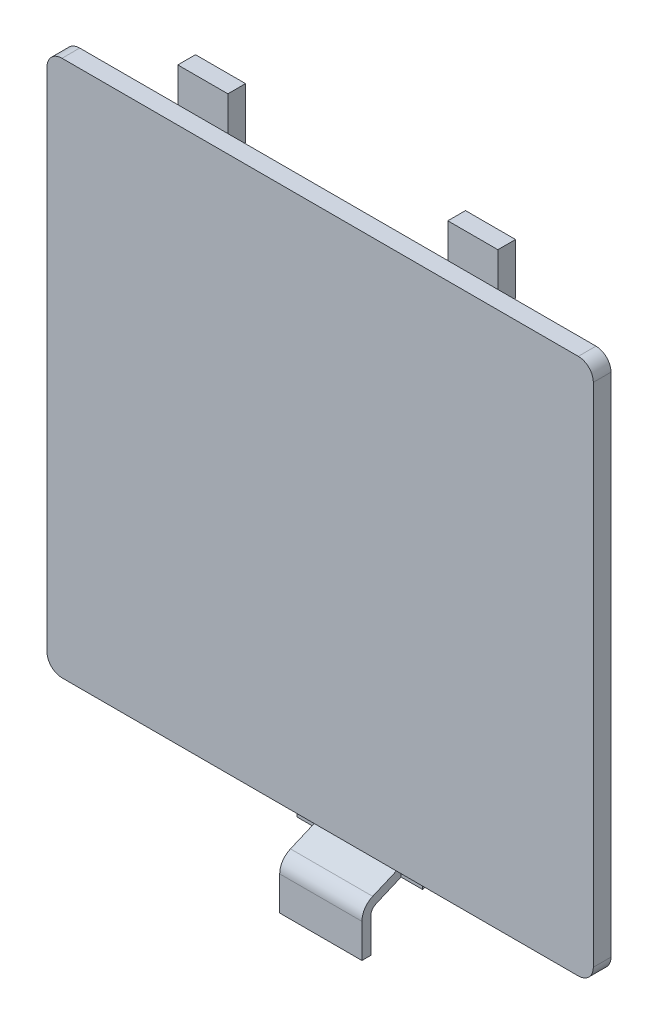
ISO-10303-21;
HEADER;
FILE_DESCRIPTION(('STEP AP214'),'2;1');
FILE_NAME('part.step','',(''),(''),'','','');
FILE_SCHEMA(('AUTOMOTIVE_DESIGN { 1 0 10303 214 1 1 1 1 }'));
ENDSEC;
DATA;
#1=APPLICATION_CONTEXT('core data for automotive mechanical design processes');
#2=APPLICATION_PROTOCOL_DEFINITION('international standard','automotive_design',2000,#1);
#3=PRODUCT_CONTEXT('',#1,'mechanical');
#4=PRODUCT('Part','Part','',(#3));
#5=PRODUCT_RELATED_PRODUCT_CATEGORY('part','',(#4));
#6=PRODUCT_DEFINITION_FORMATION('','',#4);
#7=PRODUCT_DEFINITION_CONTEXT('part definition',#1,'design');
#8=PRODUCT_DEFINITION('design','',#6,#7);
#9=PRODUCT_DEFINITION_SHAPE('','',#8);
#10=(LENGTH_UNIT() NAMED_UNIT(*) SI_UNIT(.MILLI.,.METRE.));
#11=(NAMED_UNIT(*) PLANE_ANGLE_UNIT() SI_UNIT($,.RADIAN.));
#12=(NAMED_UNIT(*) SI_UNIT($,.STERADIAN.) SOLID_ANGLE_UNIT());
#13=UNCERTAINTY_MEASURE_WITH_UNIT(LENGTH_MEASURE(1.E-05),#10,'distance_accuracy_value','');
#14=(GEOMETRIC_REPRESENTATION_CONTEXT(3) GLOBAL_UNCERTAINTY_ASSIGNED_CONTEXT((#13)) GLOBAL_UNIT_ASSIGNED_CONTEXT((#10,
#11,#12)) REPRESENTATION_CONTEXT('',''));
#15=CARTESIAN_POINT('',(0.,0.,0.));
#16=DIRECTION('',(0.,0.,1.));
#17=DIRECTION('',(1.,0.,0.));
#18=AXIS2_PLACEMENT_3D('',#15,#16,#17);
#19=CARTESIAN_POINT('',(29.2,20.6517184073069,-2.));
#20=DIRECTION('',(0.,0.,-1.));
#21=DIRECTION('',(0.,1.,0.));
#22=AXIS2_PLACEMENT_3D('',#19,#20,#21);
#23=PLANE('',#22);
#24=DIRECTION('',(0.,1.,0.));
#25=VECTOR('',#24,1.);
#26=CARTESIAN_POINT('',(7.1,-38.4982815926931,-2.));
#27=LINE('',#26,#25);
#28=CARTESIAN_POINT('',(7.1,-38.3482815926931,-2.));
#29=VERTEX_POINT('',#28);
#30=CARTESIAN_POINT('',(7.1,-37.4982815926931,-2.));
#31=VERTEX_POINT('',#30);
#32=EDGE_CURVE('E487',#29,#31,#27,.T.);
#33=ORIENTED_EDGE('',*,*,#32,.T.);
#34=DIRECTION('',(-1.,0.,0.));
#35=VECTOR('',#34,1.);
#36=CARTESIAN_POINT('',(7.1,-37.4982815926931,-2.));
#37=LINE('',#36,#35);
#38=CARTESIAN_POINT('',(-7.1,-37.4982815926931,-2.));
#39=VERTEX_POINT('',#38);
#40=EDGE_CURVE('E289',#31,#39,#37,.T.);
#41=ORIENTED_EDGE('',*,*,#40,.T.);
#42=DIRECTION('',(0.,1.,0.));
#43=VECTOR('',#42,1.);
#44=CARTESIAN_POINT('',(-7.1,-38.4982815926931,-2.));
#45=LINE('',#44,#43);
#46=CARTESIAN_POINT('',(-7.1,-38.3482815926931,-2.));
#47=VERTEX_POINT('',#46);
#48=EDGE_CURVE('E458',#47,#39,#45,.T.);
#49=ORIENTED_EDGE('',*,*,#48,.F.);
#50=DIRECTION('',(1.,0.,0.));
#51=VECTOR('',#50,1.);
#52=CARTESIAN_POINT('',(7.85,-38.3482815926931,-2.));
#53=LINE('',#52,#51);
#54=CARTESIAN_POINT('',(-29.2,-38.3482815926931,-2.));
#55=VERTEX_POINT('',#54);
#56=EDGE_CURVE('E396',#55,#47,#53,.T.);
#57=ORIENTED_EDGE('',*,*,#56,.F.);
#58=CARTESIAN_POINT('',(-29.2,-36.6482815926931,-2.));
#59=DIRECTION('',(0.,0.,-1.));
#60=DIRECTION('',(-1.,0.,0.));
#61=AXIS2_PLACEMENT_3D('',#58,#59,#60);
#62=CIRCLE('',#61,1.70000000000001);
#63=CARTESIAN_POINT('',(-30.9,-36.6482815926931,-2.));
#64=VERTEX_POINT('',#63);
#65=EDGE_CURVE('E401',#64,#55,#62,.F.);
#66=ORIENTED_EDGE('',*,*,#65,.F.);
#67=DIRECTION('',(0.,-1.,0.));
#68=VECTOR('',#67,1.);
#69=CARTESIAN_POINT('',(-30.9,20.6517184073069,-2.));
#70=LINE('',#69,#68);
#71=CARTESIAN_POINT('',(-30.9,20.6517184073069,-2.));
#72=VERTEX_POINT('',#71);
#73=EDGE_CURVE('E405',#72,#64,#70,.T.);
#74=ORIENTED_EDGE('',*,*,#73,.F.);
#75=CARTESIAN_POINT('',(-29.2,20.6517184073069,-2.));
#76=DIRECTION('',(0.,0.,-1.));
#77=DIRECTION('',(-1.,0.,0.));
#78=AXIS2_PLACEMENT_3D('',#75,#76,#77);
#79=CIRCLE('',#78,1.69999999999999);
#80=CARTESIAN_POINT('',(-29.2,22.3517184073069,-2.));
#81=VERTEX_POINT('',#80);
#82=EDGE_CURVE('E409',#81,#72,#79,.F.);
#83=ORIENTED_EDGE('',*,*,#82,.F.);
#84=DIRECTION('',(-1.,0.,0.));
#85=VECTOR('',#84,1.);
#86=CARTESIAN_POINT('',(29.2,22.3517184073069,-2.));
#87=LINE('',#86,#85);
#88=CARTESIAN_POINT('',(-18.1031935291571,22.3517184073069,-2.));
#89=VERTEX_POINT('',#88);
#90=EDGE_CURVE('E417',#89,#81,#87,.T.);
#91=ORIENTED_EDGE('',*,*,#90,.F.);
#92=DIRECTION('',(0.,1.,0.));
#93=VECTOR('',#92,1.);
#94=CARTESIAN_POINT('',(-18.1031935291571,20.4695314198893,-2.));
#95=LINE('',#94,#93);
#96=CARTESIAN_POINT('',(-18.1031935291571,20.4695314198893,-2.));
#97=VERTEX_POINT('',#96);
#98=EDGE_CURVE('E312',#97,#89,#95,.T.);
#99=ORIENTED_EDGE('',*,*,#98,.F.);
#100=DIRECTION('',(-1.,0.,0.));
#101=VECTOR('',#100,1.);
#102=CARTESIAN_POINT('',(-18.1031935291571,20.4695314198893,-2.));
#103=LINE('',#102,#101);
#104=CARTESIAN_POINT('',(-12.4392199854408,20.4695314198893,-2.));
#105=VERTEX_POINT('',#104);
#106=EDGE_CURVE('E308',#105,#97,#103,.T.);
#107=ORIENTED_EDGE('',*,*,#106,.F.);
#108=DIRECTION('',(0.,-1.,0.));
#109=VECTOR('',#108,1.);
#110=CARTESIAN_POINT('',(-12.4392199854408,20.4695314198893,-2.));
#111=LINE('',#110,#109);
#112=CARTESIAN_POINT('',(-12.4392199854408,22.3517184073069,-2.));
#113=VERTEX_POINT('',#112);
#114=EDGE_CURVE('E316',#113,#105,#111,.T.);
#115=ORIENTED_EDGE('',*,*,#114,.F.);
#116=CARTESIAN_POINT('',(12.4392199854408,22.3517184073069,-2.));
#117=VERTEX_POINT('',#116);
#118=EDGE_CURVE('E869',#117,#113,#87,.T.);
#119=ORIENTED_EDGE('',*,*,#118,.F.);
#120=DIRECTION('',(0.,1.,0.));
#121=VECTOR('',#120,1.);
#122=CARTESIAN_POINT('',(12.4392199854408,20.4695314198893,-2.));
#123=LINE('',#122,#121);
#124=CARTESIAN_POINT('',(12.4392199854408,20.4695314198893,-2.));
#125=VERTEX_POINT('',#124);
#126=EDGE_CURVE('E345',#125,#117,#123,.T.);
#127=ORIENTED_EDGE('',*,*,#126,.F.);
#128=DIRECTION('',(-1.,0.,0.));
#129=VECTOR('',#128,1.);
#130=CARTESIAN_POINT('',(18.1031935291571,20.4695314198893,-2.));
#131=LINE('',#130,#129);
#132=CARTESIAN_POINT('',(18.1031935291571,20.4695314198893,-2.));
#133=VERTEX_POINT('',#132);
#134=EDGE_CURVE('E341',#133,#125,#131,.T.);
#135=ORIENTED_EDGE('',*,*,#134,.F.);
#136=DIRECTION('',(0.,-1.,0.));
#137=VECTOR('',#136,1.);
#138=CARTESIAN_POINT('',(18.1031935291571,20.4695314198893,-2.));
#139=LINE('',#138,#137);
#140=CARTESIAN_POINT('',(18.1031935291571,22.3517184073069,-2.));
#141=VERTEX_POINT('',#140);
#142=EDGE_CURVE('E11',#141,#133,#139,.T.);
#143=ORIENTED_EDGE('',*,*,#142,.F.);
#144=CARTESIAN_POINT('',(29.2,22.3517184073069,-2.));
#145=VERTEX_POINT('',#144);
#146=EDGE_CURVE('E413',#145,#141,#87,.T.);
#147=ORIENTED_EDGE('',*,*,#146,.F.);
#148=CARTESIAN_POINT('',(29.2,20.6517184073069,-2.));
#149=DIRECTION('',(0.,0.,-1.));
#150=DIRECTION('',(-1.,0.,0.));
#151=AXIS2_PLACEMENT_3D('',#148,#149,#150);
#152=CIRCLE('',#151,1.69999999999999);
#153=CARTESIAN_POINT('',(30.9,20.6517184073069,-2.));
#154=VERTEX_POINT('',#153);
#155=EDGE_CURVE('E418',#154,#145,#152,.F.);
#156=ORIENTED_EDGE('',*,*,#155,.F.);
#157=DIRECTION('',(0.,1.,0.));
#158=VECTOR('',#157,1.);
#159=CARTESIAN_POINT('',(30.9,-36.6482815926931,-2.));
#160=LINE('',#159,#158);
#161=CARTESIAN_POINT('',(30.9,-36.6482815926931,-2.));
#162=VERTEX_POINT('',#161);
#163=EDGE_CURVE('E423',#162,#154,#160,.T.);
#164=ORIENTED_EDGE('',*,*,#163,.F.);
#165=CARTESIAN_POINT('',(29.2,-36.6482815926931,-2.));
#166=DIRECTION('',(0.,0.,-1.));
#167=DIRECTION('',(-1.,0.,0.));
#168=AXIS2_PLACEMENT_3D('',#165,#166,#167);
#169=CIRCLE('',#168,1.70000000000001);
#170=CARTESIAN_POINT('',(29.2,-38.3482815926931,-2.));
#171=VERTEX_POINT('',#170);
#172=EDGE_CURVE('E427',#171,#162,#169,.F.);
#173=ORIENTED_EDGE('',*,*,#172,.F.);
#174=EDGE_CURVE('E375',#29,#171,#53,.T.);
#175=ORIENTED_EDGE('',*,*,#174,.F.);
#176=EDGE_LOOP('',(#33,#41,#49,#57,#66,#74,#83,#91,#99,#107,#115,#119,#127,#135,#143,#147,#156,
#164,#173,#175));
#177=FACE_BOUND('',#176,.T.);
#178=ADVANCED_FACE('F26',(#177),#23,.T.);
#179=CARTESIAN_POINT('',(-29.2,-36.6482815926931,0.));
#180=DIRECTION('',(0.,0.,1.));
#181=DIRECTION('',(1.,0.,0.));
#182=AXIS2_PLACEMENT_3D('',#179,#180,#181);
#183=PLANE('',#182);
#184=CARTESIAN_POINT('',(-29.2,-36.6482815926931,0.));
#185=DIRECTION('',(0.,0.,1.));
#186=DIRECTION('',(1.,0.,0.));
#187=AXIS2_PLACEMENT_3D('',#184,#185,#186);
#188=CIRCLE('',#187,1.70000000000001);
#189=CARTESIAN_POINT('',(-30.9,-36.6482815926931,0.));
#190=VERTEX_POINT('',#189);
#191=CARTESIAN_POINT('',(-29.2,-38.3482815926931,0.));
#192=VERTEX_POINT('',#191);
#193=EDGE_CURVE('E371',#190,#192,#188,.T.);
#194=ORIENTED_EDGE('',*,*,#193,.T.);
#195=DIRECTION('',(1.,0.,0.));
#196=VECTOR('',#195,1.);
#197=CARTESIAN_POINT('',(7.85,-38.3482815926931,0.));
#198=LINE('',#197,#196);
#199=CARTESIAN_POINT('',(29.2,-38.3482815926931,0.));
#200=VERTEX_POINT('',#199);
#201=EDGE_CURVE('E391',#192,#200,#198,.T.);
#202=ORIENTED_EDGE('',*,*,#201,.T.);
#203=CARTESIAN_POINT('',(29.2,-36.6482815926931,0.));
#204=DIRECTION('',(0.,0.,1.));
#205=DIRECTION('',(1.,0.,0.));
#206=AXIS2_PLACEMENT_3D('',#203,#204,#205);
#207=CIRCLE('',#206,1.70000000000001);
#208=CARTESIAN_POINT('',(30.9,-36.6482815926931,0.));
#209=VERTEX_POINT('',#208);
#210=EDGE_CURVE('E388',#200,#209,#207,.T.);
#211=ORIENTED_EDGE('',*,*,#210,.T.);
#212=DIRECTION('',(0.,1.,0.));
#213=VECTOR('',#212,1.);
#214=CARTESIAN_POINT('',(30.9,-36.6482815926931,0.));
#215=LINE('',#214,#213);
#216=CARTESIAN_POINT('',(30.9,20.6517184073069,0.));
#217=VERTEX_POINT('',#216);
#218=EDGE_CURVE('E385',#209,#217,#215,.T.);
#219=ORIENTED_EDGE('',*,*,#218,.T.);
#220=CARTESIAN_POINT('',(29.2,20.6517184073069,0.));
#221=DIRECTION('',(0.,0.,1.));
#222=DIRECTION('',(1.,0.,0.));
#223=AXIS2_PLACEMENT_3D('',#220,#221,#222);
#224=CIRCLE('',#223,1.69999999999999);
#225=CARTESIAN_POINT('',(29.2,22.3517184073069,0.));
#226=VERTEX_POINT('',#225);
#227=EDGE_CURVE('E382',#217,#226,#224,.T.);
#228=ORIENTED_EDGE('',*,*,#227,.T.);
#229=DIRECTION('',(-1.,0.,0.));
#230=VECTOR('',#229,1.);
#231=CARTESIAN_POINT('',(29.2,22.3517184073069,0.));
#232=LINE('',#231,#230);
#233=CARTESIAN_POINT('',(-29.2,22.3517184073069,0.));
#234=VERTEX_POINT('',#233);
#235=EDGE_CURVE('E379',#226,#234,#232,.T.);
#236=ORIENTED_EDGE('',*,*,#235,.T.);
#237=CARTESIAN_POINT('',(-29.2,20.6517184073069,0.));
#238=DIRECTION('',(0.,0.,1.));
#239=DIRECTION('',(1.,0.,0.));
#240=AXIS2_PLACEMENT_3D('',#237,#238,#239);
#241=CIRCLE('',#240,1.69999999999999);
#242=CARTESIAN_POINT('',(-30.9,20.6517184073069,0.));
#243=VERTEX_POINT('',#242);
#244=EDGE_CURVE('E376',#234,#243,#241,.T.);
#245=ORIENTED_EDGE('',*,*,#244,.T.);
#246=DIRECTION('',(0.,-1.,0.));
#247=VECTOR('',#246,1.);
#248=CARTESIAN_POINT('',(-30.9,20.6517184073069,0.));
#249=LINE('',#248,#247);
#250=EDGE_CURVE('E372',#243,#190,#249,.T.);
#251=ORIENTED_EDGE('',*,*,#250,.T.);
#252=EDGE_LOOP('',(#194,#202,#211,#219,#228,#236,#245,#251));
#253=FACE_BOUND('',#252,.T.);
#254=ADVANCED_FACE('F449',(#253),#183,.T.);
#255=CARTESIAN_POINT('',(7.85,-38.3482815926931,-88.6240728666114));
#256=DIRECTION('',(0.,-1.,0.));
#257=DIRECTION('',(0.,0.,-1.));
#258=AXIS2_PLACEMENT_3D('',#255,#256,#257);
#259=PLANE('',#258);
#260=DIRECTION('',(0.,0.,1.));
#261=VECTOR('',#260,1.);
#262=CARTESIAN_POINT('',(-29.2,-38.3482815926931,-88.6240728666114));
#263=LINE('',#262,#261);
#264=EDGE_CURVE('E29',#55,#192,#263,.T.);
#265=ORIENTED_EDGE('',*,*,#264,.F.);
#266=ORIENTED_EDGE('',*,*,#56,.T.);
#267=EDGE_CURVE('E400',#47,#29,#53,.T.);
#268=ORIENTED_EDGE('',*,*,#267,.T.);
#269=ORIENTED_EDGE('',*,*,#174,.T.);
#270=DIRECTION('',(0.,0.,1.));
#271=VECTOR('',#270,1.);
#272=CARTESIAN_POINT('',(29.2,-38.3482815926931,-88.6240728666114));
#273=LINE('',#272,#271);
#274=EDGE_CURVE('E399',#171,#200,#273,.T.);
#275=ORIENTED_EDGE('',*,*,#274,.T.);
#276=ORIENTED_EDGE('',*,*,#201,.F.);
#277=EDGE_LOOP('',(#265,#266,#268,#269,#275,#276));
#278=FACE_BOUND('',#277,.T.);
#279=ADVANCED_FACE('F440',(#278),#259,.T.);
#280=CARTESIAN_POINT('',(29.2,-36.6482815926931,-88.6240728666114));
#281=DIRECTION('',(0.,0.,1.));
#282=DIRECTION('',(1.,0.,0.));
#283=AXIS2_PLACEMENT_3D('',#280,#281,#282);
#284=CYLINDRICAL_SURFACE('',#283,1.70000000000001);
#285=ORIENTED_EDGE('',*,*,#274,.F.);
#286=ORIENTED_EDGE('',*,*,#172,.T.);
#287=DIRECTION('',(0.,0.,1.));
#288=VECTOR('',#287,1.);
#289=CARTESIAN_POINT('',(30.9,-36.6482815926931,-88.6240728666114));
#290=LINE('',#289,#288);
#291=EDGE_CURVE('E426',#162,#209,#290,.T.);
#292=ORIENTED_EDGE('',*,*,#291,.T.);
#293=ORIENTED_EDGE('',*,*,#210,.F.);
#294=EDGE_LOOP('',(#285,#286,#292,#293));
#295=FACE_BOUND('',#294,.T.);
#296=ADVANCED_FACE('F445',(#295),#284,.T.);
#297=CARTESIAN_POINT('',(30.9,-36.6482815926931,-88.6240728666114));
#298=DIRECTION('',(1.,0.,0.));
#299=DIRECTION('',(0.,1.,0.));
#300=AXIS2_PLACEMENT_3D('',#297,#298,#299);
#301=PLANE('',#300);
#302=ORIENTED_EDGE('',*,*,#291,.F.);
#303=ORIENTED_EDGE('',*,*,#163,.T.);
#304=DIRECTION('',(0.,0.,1.));
#305=VECTOR('',#304,1.);
#306=CARTESIAN_POINT('',(30.9,20.6517184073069,-88.6240728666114));
#307=LINE('',#306,#305);
#308=EDGE_CURVE('E422',#154,#217,#307,.T.);
#309=ORIENTED_EDGE('',*,*,#308,.T.);
#310=ORIENTED_EDGE('',*,*,#218,.F.);
#311=EDGE_LOOP('',(#302,#303,#309,#310));
#312=FACE_BOUND('',#311,.T.);
#313=ADVANCED_FACE('F606',(#312),#301,.T.);
#314=CARTESIAN_POINT('',(29.2,20.6517184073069,-88.6240728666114));
#315=DIRECTION('',(0.,0.,1.));
#316=DIRECTION('',(1.,0.,0.));
#317=AXIS2_PLACEMENT_3D('',#314,#315,#316);
#318=CYLINDRICAL_SURFACE('',#317,1.69999999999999);
#319=ORIENTED_EDGE('',*,*,#308,.F.);
#320=ORIENTED_EDGE('',*,*,#155,.T.);
#321=DIRECTION('',(0.,0.,1.));
#322=VECTOR('',#321,1.);
#323=CARTESIAN_POINT('',(29.2,22.3517184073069,-88.6240728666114));
#324=LINE('',#323,#322);
#325=EDGE_CURVE('E421',#145,#226,#324,.T.);
#326=ORIENTED_EDGE('',*,*,#325,.T.);
#327=ORIENTED_EDGE('',*,*,#227,.F.);
#328=EDGE_LOOP('',(#319,#320,#326,#327));
#329=FACE_BOUND('',#328,.T.);
#330=ADVANCED_FACE('F602',(#329),#318,.T.);
#331=CARTESIAN_POINT('',(29.2,22.3517184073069,-88.6240728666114));
#332=DIRECTION('',(0.,1.,0.));
#333=DIRECTION('',(-1.,0.,0.));
#334=AXIS2_PLACEMENT_3D('',#331,#332,#333);
#335=PLANE('',#334);
#336=ORIENTED_EDGE('',*,*,#325,.F.);
#337=ORIENTED_EDGE('',*,*,#146,.T.);
#338=EDGE_CURVE('E416',#141,#117,#87,.T.);
#339=ORIENTED_EDGE('',*,*,#338,.T.);
#340=ORIENTED_EDGE('',*,*,#118,.T.);
#341=EDGE_CURVE('E866',#113,#89,#87,.T.);
#342=ORIENTED_EDGE('',*,*,#341,.T.);
#343=ORIENTED_EDGE('',*,*,#90,.T.);
#344=DIRECTION('',(0.,0.,1.));
#345=VECTOR('',#344,1.);
#346=CARTESIAN_POINT('',(-29.2,22.3517184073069,-88.6240728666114));
#347=LINE('',#346,#345);
#348=EDGE_CURVE('E412',#81,#234,#347,.T.);
#349=ORIENTED_EDGE('',*,*,#348,.T.);
#350=ORIENTED_EDGE('',*,*,#235,.F.);
#351=EDGE_LOOP('',(#336,#337,#339,#340,#342,#343,#349,#350));
#352=FACE_BOUND('',#351,.T.);
#353=ADVANCED_FACE('F598',(#352),#335,.T.);
#354=CARTESIAN_POINT('',(-29.2,20.6517184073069,-88.6240728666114));
#355=DIRECTION('',(0.,0.,1.));
#356=DIRECTION('',(1.,0.,0.));
#357=AXIS2_PLACEMENT_3D('',#354,#355,#356);
#358=CYLINDRICAL_SURFACE('',#357,1.69999999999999);
#359=ORIENTED_EDGE('',*,*,#348,.F.);
#360=ORIENTED_EDGE('',*,*,#82,.T.);
#361=DIRECTION('',(0.,0.,1.));
#362=VECTOR('',#361,1.);
#363=CARTESIAN_POINT('',(-30.9,20.6517184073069,-88.6240728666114));
#364=LINE('',#363,#362);
#365=EDGE_CURVE('E408',#72,#243,#364,.T.);
#366=ORIENTED_EDGE('',*,*,#365,.T.);
#367=ORIENTED_EDGE('',*,*,#244,.F.);
#368=EDGE_LOOP('',(#359,#360,#366,#367));
#369=FACE_BOUND('',#368,.T.);
#370=ADVANCED_FACE('F594',(#369),#358,.T.);
#371=CARTESIAN_POINT('',(-30.9,20.6517184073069,-88.6240728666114));
#372=DIRECTION('',(-1.,0.,0.));
#373=DIRECTION('',(0.,0.,1.));
#374=AXIS2_PLACEMENT_3D('',#371,#372,#373);
#375=PLANE('',#374);
#376=ORIENTED_EDGE('',*,*,#365,.F.);
#377=ORIENTED_EDGE('',*,*,#73,.T.);
#378=DIRECTION('',(0.,0.,1.));
#379=VECTOR('',#378,1.);
#380=CARTESIAN_POINT('',(-30.9,-36.6482815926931,-88.6240728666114));
#381=LINE('',#380,#379);
#382=EDGE_CURVE('E404',#64,#190,#381,.T.);
#383=ORIENTED_EDGE('',*,*,#382,.T.);
#384=ORIENTED_EDGE('',*,*,#250,.F.);
#385=EDGE_LOOP('',(#376,#377,#383,#384));
#386=FACE_BOUND('',#385,.T.);
#387=ADVANCED_FACE('F591',(#386),#375,.T.);
#388=CARTESIAN_POINT('',(-29.2,-36.6482815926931,-88.6240728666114));
#389=DIRECTION('',(0.,0.,1.));
#390=DIRECTION('',(1.,0.,0.));
#391=AXIS2_PLACEMENT_3D('',#388,#389,#390);
#392=CYLINDRICAL_SURFACE('',#391,1.70000000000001);
#393=ORIENTED_EDGE('',*,*,#382,.F.);
#394=ORIENTED_EDGE('',*,*,#65,.T.);
#395=ORIENTED_EDGE('',*,*,#264,.T.);
#396=ORIENTED_EDGE('',*,*,#193,.F.);
#397=EDGE_LOOP('',(#393,#394,#395,#396));
#398=FACE_BOUND('',#397,.T.);
#399=ADVANCED_FACE('F454',(#398),#392,.T.);
#400=CARTESIAN_POINT('',(18.1031935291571,26.2494907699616,-2.));
#401=DIRECTION('',(0.,0.,1.));
#402=DIRECTION('',(1.,0.,0.));
#403=AXIS2_PLACEMENT_3D('',#400,#401,#402);
#404=PLANE('',#403);
#405=ORIENTED_EDGE('',*,*,#338,.F.);
#406=CARTESIAN_POINT('',(18.1031935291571,26.2494907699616,-2.));
#407=VERTEX_POINT('',#406);
#408=EDGE_CURVE('E35',#407,#141,#139,.T.);
#409=ORIENTED_EDGE('',*,*,#408,.F.);
#410=DIRECTION('',(1.,0.,0.));
#411=VECTOR('',#410,1.);
#412=CARTESIAN_POINT('',(18.1031935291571,26.2494907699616,-2.));
#413=LINE('',#412,#411);
#414=CARTESIAN_POINT('',(12.4392199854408,26.2494907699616,-2.));
#415=VERTEX_POINT('',#414);
#416=EDGE_CURVE('E348',#415,#407,#413,.T.);
#417=ORIENTED_EDGE('',*,*,#416,.F.);
#418=EDGE_CURVE('E344',#117,#415,#123,.T.);
#419=ORIENTED_EDGE('',*,*,#418,.F.);
#420=EDGE_LOOP('',(#405,#409,#417,#419));
#421=FACE_BOUND('',#420,.T.);
#422=ADVANCED_FACE('F590',(#421),#404,.T.);
#423=CARTESIAN_POINT('',(18.1031935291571,20.4695314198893,-4.));
#424=DIRECTION('',(-1.,0.,0.));
#425=DIRECTION('',(0.,0.,1.));
#426=AXIS2_PLACEMENT_3D('',#423,#424,#425);
#427=PLANE('',#426);
#428=ORIENTED_EDGE('',*,*,#408,.T.);
#429=ORIENTED_EDGE('',*,*,#142,.T.);
#430=DIRECTION('',(0.,0.,1.));
#431=VECTOR('',#430,1.);
#432=CARTESIAN_POINT('',(18.1031935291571,20.4695314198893,-4.));
#433=LINE('',#432,#431);
#434=CARTESIAN_POINT('',(18.1031935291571,20.4695314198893,-4.));
#435=VERTEX_POINT('',#434);
#436=EDGE_CURVE('E368',#435,#133,#433,.T.);
#437=ORIENTED_EDGE('',*,*,#436,.F.);
#438=DIRECTION('',(0.,-1.,0.));
#439=VECTOR('',#438,1.);
#440=CARTESIAN_POINT('',(18.1031935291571,20.4695314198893,-4.));
#441=LINE('',#440,#439);
#442=CARTESIAN_POINT('',(18.1031935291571,26.2494907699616,-4.));
#443=VERTEX_POINT('',#442);
#444=EDGE_CURVE('E350',#443,#435,#441,.T.);
#445=ORIENTED_EDGE('',*,*,#444,.F.);
#446=DIRECTION('',(0.,0.,1.));
#447=VECTOR('',#446,1.);
#448=CARTESIAN_POINT('',(18.1031935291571,26.2494907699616,-4.));
#449=LINE('',#448,#447);
#450=EDGE_CURVE('E359',#443,#407,#449,.T.);
#451=ORIENTED_EDGE('',*,*,#450,.T.);
#452=EDGE_LOOP('',(#428,#429,#437,#445,#451));
#453=FACE_BOUND('',#452,.T.);
#454=ADVANCED_FACE('F586',(#453),#427,.F.);
#455=CARTESIAN_POINT('',(18.1031935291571,20.4695314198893,-4.));
#456=DIRECTION('',(0.,1.,0.));
#457=DIRECTION('',(0.,0.,1.));
#458=AXIS2_PLACEMENT_3D('',#455,#456,#457);
#459=PLANE('',#458);
#460=ORIENTED_EDGE('',*,*,#134,.T.);
#461=DIRECTION('',(0.,0.,1.));
#462=VECTOR('',#461,1.);
#463=CARTESIAN_POINT('',(12.4392199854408,20.4695314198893,-4.));
#464=LINE('',#463,#462);
#465=CARTESIAN_POINT('',(12.4392199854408,20.4695314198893,-4.));
#466=VERTEX_POINT('',#465);
#467=EDGE_CURVE('E365',#466,#125,#464,.T.);
#468=ORIENTED_EDGE('',*,*,#467,.F.);
#469=DIRECTION('',(-1.,0.,0.));
#470=VECTOR('',#469,1.);
#471=CARTESIAN_POINT('',(18.1031935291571,20.4695314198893,-4.));
#472=LINE('',#471,#470);
#473=EDGE_CURVE('E353',#435,#466,#472,.T.);
#474=ORIENTED_EDGE('',*,*,#473,.F.);
#475=ORIENTED_EDGE('',*,*,#436,.T.);
#476=EDGE_LOOP('',(#460,#468,#474,#475));
#477=FACE_BOUND('',#476,.T.);
#478=ADVANCED_FACE('F651',(#477),#459,.F.);
#479=CARTESIAN_POINT('',(12.4392199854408,20.4695314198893,-4.));
#480=DIRECTION('',(1.,0.,0.));
#481=DIRECTION('',(0.,0.,-1.));
#482=AXIS2_PLACEMENT_3D('',#479,#480,#481);
#483=PLANE('',#482);
#484=ORIENTED_EDGE('',*,*,#126,.T.);
#485=ORIENTED_EDGE('',*,*,#418,.T.);
#486=DIRECTION('',(0.,0.,1.));
#487=VECTOR('',#486,1.);
#488=CARTESIAN_POINT('',(12.4392199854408,26.2494907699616,-4.));
#489=LINE('',#488,#487);
#490=CARTESIAN_POINT('',(12.4392199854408,26.2494907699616,-4.));
#491=VERTEX_POINT('',#490);
#492=EDGE_CURVE('E362',#491,#415,#489,.T.);
#493=ORIENTED_EDGE('',*,*,#492,.F.);
#494=DIRECTION('',(0.,1.,0.));
#495=VECTOR('',#494,1.);
#496=CARTESIAN_POINT('',(12.4392199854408,20.4695314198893,-4.));
#497=LINE('',#496,#495);
#498=EDGE_CURVE('E355',#466,#491,#497,.T.);
#499=ORIENTED_EDGE('',*,*,#498,.F.);
#500=ORIENTED_EDGE('',*,*,#467,.T.);
#501=EDGE_LOOP('',(#484,#485,#493,#499,#500));
#502=FACE_BOUND('',#501,.T.);
#503=ADVANCED_FACE('F658',(#502),#483,.F.);
#504=CARTESIAN_POINT('',(18.1031935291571,26.2494907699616,-4.));
#505=DIRECTION('',(0.,-1.,0.));
#506=DIRECTION('',(0.,0.,-1.));
#507=AXIS2_PLACEMENT_3D('',#504,#505,#506);
#508=PLANE('',#507);
#509=ORIENTED_EDGE('',*,*,#416,.T.);
#510=ORIENTED_EDGE('',*,*,#450,.F.);
#511=DIRECTION('',(1.,0.,0.));
#512=VECTOR('',#511,1.);
#513=CARTESIAN_POINT('',(18.1031935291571,26.2494907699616,-4.));
#514=LINE('',#513,#512);
#515=EDGE_CURVE('E357',#491,#443,#514,.T.);
#516=ORIENTED_EDGE('',*,*,#515,.F.);
#517=ORIENTED_EDGE('',*,*,#492,.T.);
#518=EDGE_LOOP('',(#509,#510,#516,#517));
#519=FACE_BOUND('',#518,.T.);
#520=ADVANCED_FACE('F665',(#519),#508,.F.);
#521=CARTESIAN_POINT('',(18.1031935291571,26.2494907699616,-4.));
#522=DIRECTION('',(0.,0.,1.));
#523=DIRECTION('',(1.,0.,0.));
#524=AXIS2_PLACEMENT_3D('',#521,#522,#523);
#525=PLANE('',#524);
#526=ORIENTED_EDGE('',*,*,#444,.T.);
#527=ORIENTED_EDGE('',*,*,#473,.T.);
#528=ORIENTED_EDGE('',*,*,#498,.T.);
#529=ORIENTED_EDGE('',*,*,#515,.T.);
#530=EDGE_LOOP('',(#526,#527,#528,#529));
#531=FACE_BOUND('',#530,.T.);
#532=ADVANCED_FACE('F673',(#531),#525,.F.);
#533=CARTESIAN_POINT('',(-18.1031935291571,20.4695314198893,-4.));
#534=DIRECTION('',(0.,1.,0.));
#535=DIRECTION('',(0.,0.,1.));
#536=AXIS2_PLACEMENT_3D('',#533,#534,#535);
#537=PLANE('',#536);
#538=ORIENTED_EDGE('',*,*,#106,.T.);
#539=DIRECTION('',(0.,0.,1.));
#540=VECTOR('',#539,1.);
#541=CARTESIAN_POINT('',(-18.1031935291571,20.4695314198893,-4.));
#542=LINE('',#541,#540);
#543=CARTESIAN_POINT('',(-18.1031935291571,20.4695314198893,-4.));
#544=VERTEX_POINT('',#543);
#545=EDGE_CURVE('E338',#544,#97,#542,.T.);
#546=ORIENTED_EDGE('',*,*,#545,.F.);
#547=DIRECTION('',(-1.,0.,0.));
#548=VECTOR('',#547,1.);
#549=CARTESIAN_POINT('',(-18.1031935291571,20.4695314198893,-4.));
#550=LINE('',#549,#548);
#551=CARTESIAN_POINT('',(-12.4392199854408,20.4695314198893,-4.));
#552=VERTEX_POINT('',#551);
#553=EDGE_CURVE('E320',#552,#544,#550,.T.);
#554=ORIENTED_EDGE('',*,*,#553,.F.);
#555=DIRECTION('',(0.,0.,1.));
#556=VECTOR('',#555,1.);
#557=CARTESIAN_POINT('',(-12.4392199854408,20.4695314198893,-4.));
#558=LINE('',#557,#556);
#559=EDGE_CURVE('E329',#552,#105,#558,.T.);
#560=ORIENTED_EDGE('',*,*,#559,.T.);
#561=EDGE_LOOP('',(#538,#546,#554,#560));
#562=FACE_BOUND('',#561,.T.);
#563=ADVANCED_FACE('F681',(#562),#537,.F.);
#564=CARTESIAN_POINT('',(-18.1031935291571,20.4695314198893,-4.));
#565=DIRECTION('',(1.,0.,0.));
#566=DIRECTION('',(0.,0.,-1.));
#567=AXIS2_PLACEMENT_3D('',#564,#565,#566);
#568=PLANE('',#567);
#569=ORIENTED_EDGE('',*,*,#98,.T.);
#570=CARTESIAN_POINT('',(-18.1031935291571,26.2494907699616,-2.));
#571=VERTEX_POINT('',#570);
#572=EDGE_CURVE('E311',#89,#571,#95,.T.);
#573=ORIENTED_EDGE('',*,*,#572,.T.);
#574=DIRECTION('',(0.,0.,1.));
#575=VECTOR('',#574,1.);
#576=CARTESIAN_POINT('',(-18.1031935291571,26.2494907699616,-4.));
#577=LINE('',#576,#575);
#578=CARTESIAN_POINT('',(-18.1031935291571,26.2494907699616,-4.));
#579=VERTEX_POINT('',#578);
#580=EDGE_CURVE('E335',#579,#571,#577,.T.);
#581=ORIENTED_EDGE('',*,*,#580,.F.);
#582=DIRECTION('',(0.,1.,0.));
#583=VECTOR('',#582,1.);
#584=CARTESIAN_POINT('',(-18.1031935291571,20.4695314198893,-4.));
#585=LINE('',#584,#583);
#586=EDGE_CURVE('E323',#544,#579,#585,.T.);
#587=ORIENTED_EDGE('',*,*,#586,.F.);
#588=ORIENTED_EDGE('',*,*,#545,.T.);
#589=EDGE_LOOP('',(#569,#573,#581,#587,#588));
#590=FACE_BOUND('',#589,.T.);
#591=ADVANCED_FACE('F689',(#590),#568,.F.);
#592=CARTESIAN_POINT('',(-18.1031935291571,26.2494907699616,-4.));
#593=DIRECTION('',(0.,-1.,0.));
#594=DIRECTION('',(0.,0.,-1.));
#595=AXIS2_PLACEMENT_3D('',#592,#593,#594);
#596=PLANE('',#595);
#597=DIRECTION('',(1.,0.,0.));
#598=VECTOR('',#597,1.);
#599=CARTESIAN_POINT('',(-18.1031935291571,26.2494907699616,-2.));
#600=LINE('',#599,#598);
#601=CARTESIAN_POINT('',(-12.4392199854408,26.2494907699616,-2.));
#602=VERTEX_POINT('',#601);
#603=EDGE_CURVE('E314',#571,#602,#600,.T.);
#604=ORIENTED_EDGE('',*,*,#603,.T.);
#605=DIRECTION('',(0.,0.,1.));
#606=VECTOR('',#605,1.);
#607=CARTESIAN_POINT('',(-12.4392199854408,26.2494907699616,-4.));
#608=LINE('',#607,#606);
#609=CARTESIAN_POINT('',(-12.4392199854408,26.2494907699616,-4.));
#610=VERTEX_POINT('',#609);
#611=EDGE_CURVE('E332',#610,#602,#608,.T.);
#612=ORIENTED_EDGE('',*,*,#611,.F.);
#613=DIRECTION('',(1.,0.,0.));
#614=VECTOR('',#613,1.);
#615=CARTESIAN_POINT('',(-18.1031935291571,26.2494907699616,-4.));
#616=LINE('',#615,#614);
#617=EDGE_CURVE('E325',#579,#610,#616,.T.);
#618=ORIENTED_EDGE('',*,*,#617,.F.);
#619=ORIENTED_EDGE('',*,*,#580,.T.);
#620=EDGE_LOOP('',(#604,#612,#618,#619));
#621=FACE_BOUND('',#620,.T.);
#622=ADVANCED_FACE('F697',(#621),#596,.F.);
#623=CARTESIAN_POINT('',(-12.4392199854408,20.4695314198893,-4.));
#624=DIRECTION('',(-1.,0.,0.));
#625=DIRECTION('',(0.,0.,1.));
#626=AXIS2_PLACEMENT_3D('',#623,#624,#625);
#627=PLANE('',#626);
#628=EDGE_CURVE('E317',#602,#113,#111,.T.);
#629=ORIENTED_EDGE('',*,*,#628,.T.);
#630=ORIENTED_EDGE('',*,*,#114,.T.);
#631=ORIENTED_EDGE('',*,*,#559,.F.);
#632=DIRECTION('',(0.,-1.,0.));
#633=VECTOR('',#632,1.);
#634=CARTESIAN_POINT('',(-12.4392199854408,20.4695314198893,-4.));
#635=LINE('',#634,#633);
#636=EDGE_CURVE('E327',#610,#552,#635,.T.);
#637=ORIENTED_EDGE('',*,*,#636,.F.);
#638=ORIENTED_EDGE('',*,*,#611,.T.);
#639=EDGE_LOOP('',(#629,#630,#631,#637,#638));
#640=FACE_BOUND('',#639,.T.);
#641=ADVANCED_FACE('F705',(#640),#627,.F.);
#642=CARTESIAN_POINT('',(-12.4392199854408,20.4695314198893,-4.));
#643=DIRECTION('',(0.,0.,1.));
#644=DIRECTION('',(1.,0.,0.));
#645=AXIS2_PLACEMENT_3D('',#642,#643,#644);
#646=PLANE('',#645);
#647=ORIENTED_EDGE('',*,*,#553,.T.);
#648=ORIENTED_EDGE('',*,*,#586,.T.);
#649=ORIENTED_EDGE('',*,*,#617,.T.);
#650=ORIENTED_EDGE('',*,*,#636,.T.);
#651=EDGE_LOOP('',(#647,#648,#649,#650));
#652=FACE_BOUND('',#651,.T.);
#653=ADVANCED_FACE('F713',(#652),#646,.F.);
#654=CARTESIAN_POINT('',(-12.4392199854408,20.4695314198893,-2.));
#655=DIRECTION('',(0.,0.,1.));
#656=DIRECTION('',(1.,0.,0.));
#657=AXIS2_PLACEMENT_3D('',#654,#655,#656);
#658=PLANE('',#657);
#659=ORIENTED_EDGE('',*,*,#572,.F.);
#660=ORIENTED_EDGE('',*,*,#341,.F.);
#661=ORIENTED_EDGE('',*,*,#628,.F.);
#662=ORIENTED_EDGE('',*,*,#603,.F.);
#663=EDGE_LOOP('',(#659,#660,#661,#662));
#664=FACE_BOUND('',#663,.T.);
#665=ADVANCED_FACE('F720',(#664),#658,.T.);
#666=CARTESIAN_POINT('',(7.1,-45.3093087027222,-0.0731634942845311));
#667=DIRECTION('',(0.,0.,-1.));
#668=DIRECTION('',(0.,1.,0.));
#669=AXIS2_PLACEMENT_3D('',#666,#667,#668);
#670=PLANE('',#669);
#671=DIRECTION('',(-1.,0.,0.));
#672=VECTOR('',#671,1.);
#673=CARTESIAN_POINT('',(7.1,-45.3093087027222,-0.0731634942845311));
#674=LINE('',#673,#672);
#675=CARTESIAN_POINT('',(4.65,-45.3093087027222,-0.0731634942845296));
#676=VERTEX_POINT('',#675);
#677=CARTESIAN_POINT('',(-4.65,-45.3093087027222,-0.0731634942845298));
#678=VERTEX_POINT('',#677);
#679=EDGE_CURVE('E278',#676,#678,#674,.T.);
#680=ORIENTED_EDGE('',*,*,#679,.T.);
#681=DIRECTION('',(0.,-1.,0.));
#682=VECTOR('',#681,1.);
#683=CARTESIAN_POINT('',(-4.65,26.2504907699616,-0.0731634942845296));
#684=LINE('',#683,#682);
#685=CARTESIAN_POINT('',(-4.65,-49.1482815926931,-0.0731634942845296));
#686=VERTEX_POINT('',#685);
#687=EDGE_CURVE('E261',#678,#686,#684,.T.);
#688=ORIENTED_EDGE('',*,*,#687,.T.);
#689=DIRECTION('',(-1.,0.,0.));
#690=VECTOR('',#689,1.);
#691=CARTESIAN_POINT('',(7.1,-49.1482815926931,-0.0731634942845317));
#692=LINE('',#691,#690);
#693=CARTESIAN_POINT('',(4.65,-49.1482815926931,-0.0731634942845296));
#694=VERTEX_POINT('',#693);
#695=EDGE_CURVE('E305',#694,#686,#692,.T.);
#696=ORIENTED_EDGE('',*,*,#695,.F.);
#697=DIRECTION('',(0.,-1.,0.));
#698=VECTOR('',#697,1.);
#699=CARTESIAN_POINT('',(4.65,26.2504907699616,-0.0731634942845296));
#700=LINE('',#699,#698);
#701=EDGE_CURVE('E517',#676,#694,#700,.T.);
#702=ORIENTED_EDGE('',*,*,#701,.F.);
#703=EDGE_LOOP('',(#680,#688,#696,#702));
#704=FACE_BOUND('',#703,.T.);
#705=ADVANCED_FACE('F727',(#704),#670,.F.);
#706=CARTESIAN_POINT('',(7.1,-49.1482815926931,-1.07316349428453));
#707=DIRECTION('',(0.,-1.,0.));
#708=DIRECTION('',(0.,0.,-1.));
#709=AXIS2_PLACEMENT_3D('',#706,#707,#708);
#710=PLANE('',#709);
#711=DIRECTION('',(0.,0.,1.));
#712=VECTOR('',#711,1.);
#713=CARTESIAN_POINT('',(-4.65,-49.1482815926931,-0.0731634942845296));
#714=LINE('',#713,#712);
#715=CARTESIAN_POINT('',(-4.65,-49.1482815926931,-1.07316349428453));
#716=VERTEX_POINT('',#715);
#717=EDGE_CURVE('E553',#716,#686,#714,.T.);
#718=ORIENTED_EDGE('',*,*,#717,.F.);
#719=DIRECTION('',(-1.,0.,0.));
#720=VECTOR('',#719,1.);
#721=CARTESIAN_POINT('',(7.1,-49.1482815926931,-1.07316349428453));
#722=LINE('',#721,#720);
#723=CARTESIAN_POINT('',(4.65,-49.1482815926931,-1.07316349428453));
#724=VERTEX_POINT('',#723);
#725=EDGE_CURVE('E302',#724,#716,#722,.T.);
#726=ORIENTED_EDGE('',*,*,#725,.F.);
#727=DIRECTION('',(0.,0.,-1.));
#728=VECTOR('',#727,1.);
#729=CARTESIAN_POINT('',(4.65,-49.1482815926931,-0.0731634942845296));
#730=LINE('',#729,#728);
#731=EDGE_CURVE('E515',#694,#724,#730,.T.);
#732=ORIENTED_EDGE('',*,*,#731,.F.);
#733=ORIENTED_EDGE('',*,*,#695,.T.);
#734=EDGE_LOOP('',(#718,#726,#732,#733));
#735=FACE_BOUND('',#734,.T.);
#736=ADVANCED_FACE('F737',(#735),#710,.T.);
#737=CARTESIAN_POINT('',(7.1,-45.3093087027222,-1.07316349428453));
#738=DIRECTION('',(0.,0.,-1.));
#739=DIRECTION('',(0.,1.,0.));
#740=AXIS2_PLACEMENT_3D('',#737,#738,#739);
#741=PLANE('',#740);
#742=DIRECTION('',(0.,1.,0.));
#743=VECTOR('',#742,1.);
#744=CARTESIAN_POINT('',(-4.65,26.2504907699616,-1.07316349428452));
#745=LINE('',#744,#743);
#746=CARTESIAN_POINT('',(-4.65,-45.3093087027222,-1.07316349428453));
#747=VERTEX_POINT('',#746);
#748=EDGE_CURVE('E541',#716,#747,#745,.T.);
#749=ORIENTED_EDGE('',*,*,#748,.T.);
#750=DIRECTION('',(-1.,0.,0.));
#751=VECTOR('',#750,1.);
#752=CARTESIAN_POINT('',(7.1,-45.3093087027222,-1.07316349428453));
#753=LINE('',#752,#751);
#754=CARTESIAN_POINT('',(4.65,-45.3093087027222,-1.07316349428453));
#755=VERTEX_POINT('',#754);
#756=EDGE_CURVE('E299',#755,#747,#753,.T.);
#757=ORIENTED_EDGE('',*,*,#756,.F.);
#758=DIRECTION('',(0.,-1.,0.));
#759=VECTOR('',#758,1.);
#760=CARTESIAN_POINT('',(4.65,26.2504907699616,-1.07316349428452));
#761=LINE('',#760,#759);
#762=EDGE_CURVE('E521',#755,#724,#761,.T.);
#763=ORIENTED_EDGE('',*,*,#762,.T.);
#764=ORIENTED_EDGE('',*,*,#725,.T.);
#765=EDGE_LOOP('',(#749,#757,#763,#764));
#766=FACE_BOUND('',#765,.T.);
#767=ADVANCED_FACE('F746',(#766),#741,.T.);
#768=CARTESIAN_POINT('',(7.1,-45.3093087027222,-2.07316349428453));
#769=DIRECTION('',(-1.,0.,0.));
#770=DIRECTION('',(0.,0.,1.));
#771=AXIS2_PLACEMENT_3D('',#768,#769,#770);
#772=CYLINDRICAL_SURFACE('',#771,0.999999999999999);
#773=CARTESIAN_POINT('',(-4.65,-45.3093087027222,-2.07316349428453));
#774=DIRECTION('',(1.,0.,0.));
#775=DIRECTION('',(0.,0.,-1.));
#776=AXIS2_PLACEMENT_3D('',#773,#774,#775);
#777=CIRCLE('',#776,0.999999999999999);
#778=CARTESIAN_POINT('',(-4.65,-44.3892711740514,-1.68133324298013));
#779=VERTEX_POINT('',#778);
#780=EDGE_CURVE('E545',#747,#779,#777,.F.);
#781=ORIENTED_EDGE('',*,*,#780,.T.);
#782=DIRECTION('',(-1.,0.,0.));
#783=VECTOR('',#782,1.);
#784=CARTESIAN_POINT('',(7.1,-44.3892711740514,-1.68133324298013));
#785=LINE('',#784,#783);
#786=CARTESIAN_POINT('',(4.65,-44.3892711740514,-1.68133324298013));
#787=VERTEX_POINT('',#786);
#788=EDGE_CURVE('E296',#787,#779,#785,.T.);
#789=ORIENTED_EDGE('',*,*,#788,.F.);
#790=CARTESIAN_POINT('',(4.65,-45.3093087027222,-2.07316349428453));
#791=DIRECTION('',(-1.,0.,0.));
#792=DIRECTION('',(0.,0.,1.));
#793=AXIS2_PLACEMENT_3D('',#790,#791,#792);
#794=CIRCLE('',#793,0.999999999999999);
#795=EDGE_CURVE('E518',#787,#755,#794,.F.);
#796=ORIENTED_EDGE('',*,*,#795,.T.);
#797=ORIENTED_EDGE('',*,*,#756,.T.);
#798=EDGE_LOOP('',(#781,#789,#796,#797));
#799=FACE_BOUND('',#798,.T.);
#800=ADVANCED_FACE('F559',(#799),#772,.F.);
#801=CARTESIAN_POINT('',(7.1,-44.3892711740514,-1.68133324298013));
#802=DIRECTION('',(0.,-0.920037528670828,-0.391830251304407));
#803=DIRECTION('',(0.,0.391830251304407,-0.920037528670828));
#804=AXIS2_PLACEMENT_3D('',#801,#802,#803);
#805=PLANE('',#804);
#806=DIRECTION('',(-1.,0.,0.));
#807=VECTOR('',#806,1.);
#808=CARTESIAN_POINT('',(-4.65,-43.1888430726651,-4.5));
#809=LINE('',#808,#807);
#810=CARTESIAN_POINT('',(-4.65,-43.1888430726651,-4.5));
#811=VERTEX_POINT('',#810);
#812=CARTESIAN_POINT('',(-7.1,-43.1888430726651,-4.5));
#813=VERTEX_POINT('',#812);
#814=EDGE_CURVE('E539',#811,#813,#809,.T.);
#815=ORIENTED_EDGE('',*,*,#814,.T.);
#816=DIRECTION('',(0.,-0.391830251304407,0.920037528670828));
#817=VECTOR('',#816,1.);
#818=CARTESIAN_POINT('',(-7.1,-44.3892711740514,-1.68133324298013));
#819=LINE('',#818,#817);
#820=CARTESIAN_POINT('',(-7.1,-40.8762770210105,-9.93002371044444));
#821=VERTEX_POINT('',#820);
#822=EDGE_CURVE('E522',#821,#813,#819,.T.);
#823=ORIENTED_EDGE('',*,*,#822,.F.);
#824=DIRECTION('',(-1.,0.,0.));
#825=VECTOR('',#824,1.);
#826=CARTESIAN_POINT('',(7.1,-40.8762770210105,-9.93002371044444));
#827=LINE('',#826,#825);
#828=CARTESIAN_POINT('',(7.1,-40.8762770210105,-9.93002371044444));
#829=VERTEX_POINT('',#828);
#830=EDGE_CURVE('E294',#829,#821,#827,.T.);
#831=ORIENTED_EDGE('',*,*,#830,.F.);
#832=DIRECTION('',(0.,-0.391830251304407,0.920037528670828));
#833=VECTOR('',#832,1.);
#834=CARTESIAN_POINT('',(7.1,-44.3892711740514,-1.68133324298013));
#835=LINE('',#834,#833);
#836=CARTESIAN_POINT('',(7.1,-43.1888430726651,-4.5));
#837=VERTEX_POINT('',#836);
#838=EDGE_CURVE('E478',#829,#837,#835,.T.);
#839=ORIENTED_EDGE('',*,*,#838,.T.);
#840=DIRECTION('',(-1.,0.,0.));
#841=VECTOR('',#840,1.);
#842=CARTESIAN_POINT('',(4.65,-43.1888430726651,-4.5));
#843=LINE('',#842,#841);
#844=CARTESIAN_POINT('',(4.65,-43.1888430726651,-4.5));
#845=VERTEX_POINT('',#844);
#846=EDGE_CURVE('E50',#837,#845,#843,.T.);
#847=ORIENTED_EDGE('',*,*,#846,.T.);
#848=DIRECTION('',(0.,-0.391830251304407,0.920037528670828));
#849=VECTOR('',#848,1.);
#850=CARTESIAN_POINT('',(4.65000000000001,-34.1236245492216,-25.7855980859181));
#851=LINE('',#850,#849);
#852=EDGE_CURVE('E506',#845,#787,#851,.T.);
#853=ORIENTED_EDGE('',*,*,#852,.T.);
#854=ORIENTED_EDGE('',*,*,#788,.T.);
#855=DIRECTION('',(0.,0.391830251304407,-0.920037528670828));
#856=VECTOR('',#855,1.);
#857=CARTESIAN_POINT('',(-4.65000000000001,-34.1236245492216,-25.7855980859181));
#858=LINE('',#857,#856);
#859=EDGE_CURVE('E540',#779,#811,#858,.T.);
#860=ORIENTED_EDGE('',*,*,#859,.T.);
#861=EDGE_LOOP('',(#815,#823,#831,#839,#847,#853,#854,#860));
#862=FACE_BOUND('',#861,.T.);
#863=ADVANCED_FACE('F537',(#862),#805,.T.);
#864=CARTESIAN_POINT('',(7.1,-39.2576198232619,-9.24066176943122));
#865=DIRECTION('',(-1.,0.,0.));
#866=DIRECTION('',(0.,0.,1.));
#867=AXIS2_PLACEMENT_3D('',#864,#865,#866);
#868=CYLINDRICAL_SURFACE('',#867,1.75933823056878);
#869=ORIENTED_EDGE('',*,*,#830,.T.);
#870=CARTESIAN_POINT('',(-7.1,-39.2576198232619,-9.24066176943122));
#871=DIRECTION('',(-1.,0.,0.));
#872=DIRECTION('',(0.,0.,1.));
#873=AXIS2_PLACEMENT_3D('',#870,#871,#872);
#874=CIRCLE('',#873,1.75933823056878);
#875=CARTESIAN_POINT('',(-7.1,-37.4982815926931,-9.24066176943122));
#876=VERTEX_POINT('',#875);
#877=EDGE_CURVE('E467',#876,#821,#874,.T.);
#878=ORIENTED_EDGE('',*,*,#877,.F.);
#879=DIRECTION('',(-1.,0.,0.));
#880=VECTOR('',#879,1.);
#881=CARTESIAN_POINT('',(7.1,-37.4982815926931,-9.24066176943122));
#882=LINE('',#881,#880);
#883=CARTESIAN_POINT('',(7.1,-37.4982815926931,-9.24066176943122));
#884=VERTEX_POINT('',#883);
#885=EDGE_CURVE('E292',#884,#876,#882,.T.);
#886=ORIENTED_EDGE('',*,*,#885,.F.);
#887=CARTESIAN_POINT('',(7.1,-39.2576198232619,-9.24066176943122));
#888=DIRECTION('',(-1.,0.,0.));
#889=DIRECTION('',(0.,0.,1.));
#890=AXIS2_PLACEMENT_3D('',#887,#888,#889);
#891=CIRCLE('',#890,1.75933823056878);
#892=EDGE_CURVE('E481',#884,#829,#891,.T.);
#893=ORIENTED_EDGE('',*,*,#892,.T.);
#894=EDGE_LOOP('',(#869,#878,#886,#893));
#895=FACE_BOUND('',#894,.T.);
#896=ADVANCED_FACE('F767',(#895),#868,.T.);
#897=CARTESIAN_POINT('',(7.1,-37.4982815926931,-2.));
#898=DIRECTION('',(0.,1.,0.));
#899=DIRECTION('',(0.,0.,1.));
#900=AXIS2_PLACEMENT_3D('',#897,#898,#899);
#901=PLANE('',#900);
#902=ORIENTED_EDGE('',*,*,#885,.T.);
#903=DIRECTION('',(0.,0.,-1.));
#904=VECTOR('',#903,1.);
#905=CARTESIAN_POINT('',(-7.1,-37.4982815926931,-2.));
#906=LINE('',#905,#904);
#907=EDGE_CURVE('E464',#39,#876,#906,.T.);
#908=ORIENTED_EDGE('',*,*,#907,.F.);
#909=ORIENTED_EDGE('',*,*,#40,.F.);
#910=DIRECTION('',(0.,0.,-1.));
#911=VECTOR('',#910,1.);
#912=CARTESIAN_POINT('',(7.1,-37.4982815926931,-2.));
#913=LINE('',#912,#911);
#914=EDGE_CURVE('E484',#31,#884,#913,.T.);
#915=ORIENTED_EDGE('',*,*,#914,.T.);
#916=EDGE_LOOP('',(#902,#908,#909,#915));
#917=FACE_BOUND('',#916,.T.);
#918=ADVANCED_FACE('F775',(#917),#901,.T.);
#919=CARTESIAN_POINT('',(7.1,-38.4982815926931,-2.));
#920=DIRECTION('',(0.,0.,1.));
#921=DIRECTION('',(1.,0.,0.));
#922=AXIS2_PLACEMENT_3D('',#919,#920,#921);
#923=PLANE('',#922);
#924=CARTESIAN_POINT('',(7.1,-38.4982815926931,-2.));
#925=VERTEX_POINT('',#924);
#926=EDGE_CURVE('E488',#925,#29,#27,.T.);
#927=ORIENTED_EDGE('',*,*,#926,.T.);
#928=ORIENTED_EDGE('',*,*,#267,.F.);
#929=CARTESIAN_POINT('',(-7.1,-38.4982815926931,-2.));
#930=VERTEX_POINT('',#929);
#931=EDGE_CURVE('E463',#930,#47,#45,.T.);
#932=ORIENTED_EDGE('',*,*,#931,.F.);
#933=DIRECTION('',(-1.,0.,0.));
#934=VECTOR('',#933,1.);
#935=CARTESIAN_POINT('',(7.1,-38.4982815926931,-2.));
#936=LINE('',#935,#934);
#937=EDGE_CURVE('E287',#925,#930,#936,.T.);
#938=ORIENTED_EDGE('',*,*,#937,.F.);
#939=EDGE_LOOP('',(#927,#928,#932,#938));
#940=FACE_BOUND('',#939,.T.);
#941=ADVANCED_FACE('F782',(#940),#923,.T.);
#942=CARTESIAN_POINT('',(7.1,-38.4982815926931,-2.));
#943=DIRECTION('',(0.,1.,0.));
#944=DIRECTION('',(0.,0.,1.));
#945=AXIS2_PLACEMENT_3D('',#942,#943,#944);
#946=PLANE('',#945);
#947=ORIENTED_EDGE('',*,*,#937,.T.);
#948=DIRECTION('',(0.,0.,-1.));
#949=VECTOR('',#948,1.);
#950=CARTESIAN_POINT('',(-7.1,-38.4982815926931,-2.));
#951=LINE('',#950,#949);
#952=CARTESIAN_POINT('',(-7.1,-38.4982815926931,-9.24066176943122));
#953=VERTEX_POINT('',#952);
#954=EDGE_CURVE('E466',#930,#953,#951,.T.);
#955=ORIENTED_EDGE('',*,*,#954,.T.);
#956=DIRECTION('',(-1.,0.,0.));
#957=VECTOR('',#956,1.);
#958=CARTESIAN_POINT('',(7.1,-38.4982815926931,-9.24066176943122));
#959=LINE('',#958,#957);
#960=CARTESIAN_POINT('',(7.1,-38.4982815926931,-9.24066176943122));
#961=VERTEX_POINT('',#960);
#962=EDGE_CURVE('E280',#961,#953,#959,.T.);
#963=ORIENTED_EDGE('',*,*,#962,.F.);
#964=DIRECTION('',(0.,0.,-1.));
#965=VECTOR('',#964,1.);
#966=CARTESIAN_POINT('',(7.1,-38.4982815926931,-2.));
#967=LINE('',#966,#965);
#968=EDGE_CURVE('E490',#925,#961,#967,.T.);
#969=ORIENTED_EDGE('',*,*,#968,.F.);
#970=EDGE_LOOP('',(#947,#955,#963,#969));
#971=FACE_BOUND('',#970,.T.);
#972=ADVANCED_FACE('F790',(#971),#946,.F.);
#973=CARTESIAN_POINT('',(7.1,-39.2576198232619,-9.24066176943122));
#974=DIRECTION('',(-1.,0.,0.));
#975=DIRECTION('',(0.,0.,1.));
#976=AXIS2_PLACEMENT_3D('',#973,#974,#975);
#977=CYLINDRICAL_SURFACE('',#976,0.759338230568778);
#978=ORIENTED_EDGE('',*,*,#962,.T.);
#979=CARTESIAN_POINT('',(-7.1,-39.2576198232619,-9.24066176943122));
#980=DIRECTION('',(1.,0.,0.));
#981=DIRECTION('',(0.,0.,-1.));
#982=AXIS2_PLACEMENT_3D('',#979,#980,#981);
#983=CIRCLE('',#982,0.759338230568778);
#984=CARTESIAN_POINT('',(-7.1,-39.9562394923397,-9.53819345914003));
#985=VERTEX_POINT('',#984);
#986=EDGE_CURVE('E473',#953,#985,#983,.F.);
#987=ORIENTED_EDGE('',*,*,#986,.T.);
#988=DIRECTION('',(-1.,0.,0.));
#989=VECTOR('',#988,1.);
#990=CARTESIAN_POINT('',(7.1,-39.9562394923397,-9.53819345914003));
#991=LINE('',#990,#989);
#992=CARTESIAN_POINT('',(7.1,-39.9562394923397,-9.53819345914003));
#993=VERTEX_POINT('',#992);
#994=EDGE_CURVE('E277',#993,#985,#991,.T.);
#995=ORIENTED_EDGE('',*,*,#994,.F.);
#996=CARTESIAN_POINT('',(7.1,-39.2576198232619,-9.24066176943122));
#997=DIRECTION('',(1.,0.,0.));
#998=DIRECTION('',(0.,0.,-1.));
#999=AXIS2_PLACEMENT_3D('',#996,#997,#998);
#1000=CIRCLE('',#999,0.759338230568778);
#1001=EDGE_CURVE('E492',#961,#993,#1000,.F.);
#1002=ORIENTED_EDGE('',*,*,#1001,.F.);
#1003=EDGE_LOOP('',(#978,#987,#995,#1002));
#1004=FACE_BOUND('',#1003,.T.);
#1005=ADVANCED_FACE('F798',(#1004),#977,.F.);
#1006=CARTESIAN_POINT('',(7.1,-43.4692336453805,-1.28950299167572));
#1007=DIRECTION('',(0.,-0.920037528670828,-0.391830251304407));
#1008=DIRECTION('',(0.,0.391830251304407,-0.920037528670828));
#1009=AXIS2_PLACEMENT_3D('',#1006,#1007,#1008);
#1010=PLANE('',#1009);
#1011=DIRECTION('',(0.,-0.391830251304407,0.920037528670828));
#1012=VECTOR('',#1011,1.);
#1013=CARTESIAN_POINT('',(-7.1,-43.4692336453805,-1.28950299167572));
#1014=LINE('',#1013,#1012);
#1015=CARTESIAN_POINT('',(-7.1,-42.1019308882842,-4.5));
#1016=VERTEX_POINT('',#1015);
#1017=EDGE_CURVE('E476',#985,#1016,#1014,.T.);
#1018=ORIENTED_EDGE('',*,*,#1017,.T.);
#1019=DIRECTION('',(-1.,0.,0.));
#1020=VECTOR('',#1019,1.);
#1021=CARTESIAN_POINT('',(-4.65,-42.1019308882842,-4.5));
#1022=LINE('',#1021,#1020);
#1023=CARTESIAN_POINT('',(-4.65,-42.1019308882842,-4.5));
#1024=VERTEX_POINT('',#1023);
#1025=EDGE_CURVE('E42',#1024,#1016,#1022,.T.);
#1026=ORIENTED_EDGE('',*,*,#1025,.F.);
#1027=DIRECTION('',(0.,0.391830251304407,-0.920037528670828));
#1028=VECTOR('',#1027,1.);
#1029=CARTESIAN_POINT('',(-4.65000000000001,-33.2035870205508,-25.3937678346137));
#1030=LINE('',#1029,#1028);
#1031=CARTESIAN_POINT('',(-4.65,-43.4692336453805,-1.28950299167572));
#1032=VERTEX_POINT('',#1031);
#1033=EDGE_CURVE('E259',#1032,#1024,#1030,.T.);
#1034=ORIENTED_EDGE('',*,*,#1033,.F.);
#1035=DIRECTION('',(-1.,0.,0.));
#1036=VECTOR('',#1035,1.);
#1037=CARTESIAN_POINT('',(7.1,-43.4692336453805,-1.28950299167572));
#1038=LINE('',#1037,#1036);
#1039=CARTESIAN_POINT('',(4.65,-43.4692336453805,-1.28950299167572));
#1040=VERTEX_POINT('',#1039);
#1041=EDGE_CURVE('E272',#1040,#1032,#1038,.T.);
#1042=ORIENTED_EDGE('',*,*,#1041,.F.);
#1043=DIRECTION('',(0.,-0.391830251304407,0.920037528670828));
#1044=VECTOR('',#1043,1.);
#1045=CARTESIAN_POINT('',(4.65000000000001,-33.2035870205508,-25.3937678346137));
#1046=LINE('',#1045,#1044);
#1047=CARTESIAN_POINT('',(4.65,-42.1019308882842,-4.5));
#1048=VERTEX_POINT('',#1047);
#1049=EDGE_CURVE('E505',#1048,#1040,#1046,.T.);
#1050=ORIENTED_EDGE('',*,*,#1049,.F.);
#1051=DIRECTION('',(-1.,0.,0.));
#1052=VECTOR('',#1051,1.);
#1053=CARTESIAN_POINT('',(4.65,-42.1019308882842,-4.5));
#1054=LINE('',#1053,#1052);
#1055=CARTESIAN_POINT('',(7.1,-42.1019308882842,-4.5));
#1056=VERTEX_POINT('',#1055);
#1057=EDGE_CURVE('E504',#1056,#1048,#1054,.T.);
#1058=ORIENTED_EDGE('',*,*,#1057,.F.);
#1059=DIRECTION('',(0.,-0.391830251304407,0.920037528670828));
#1060=VECTOR('',#1059,1.);
#1061=CARTESIAN_POINT('',(7.1,-43.4692336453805,-1.28950299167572));
#1062=LINE('',#1061,#1060);
#1063=EDGE_CURVE('E282',#993,#1056,#1062,.T.);
#1064=ORIENTED_EDGE('',*,*,#1063,.F.);
#1065=ORIENTED_EDGE('',*,*,#994,.T.);
#1066=EDGE_LOOP('',(#1018,#1026,#1034,#1042,#1050,#1058,#1064,#1065));
#1067=FACE_BOUND('',#1066,.T.);
#1068=ADVANCED_FACE('F270',(#1067),#1010,.F.);
#1069=CARTESIAN_POINT('',(7.1,-45.3093087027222,-2.07316349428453));
#1070=DIRECTION('',(-1.,0.,0.));
#1071=DIRECTION('',(0.,0.,1.));
#1072=AXIS2_PLACEMENT_3D('',#1069,#1070,#1071);
#1073=CYLINDRICAL_SURFACE('',#1072,2.);
#1074=ORIENTED_EDGE('',*,*,#1041,.T.);
#1075=CARTESIAN_POINT('',(-4.65,-45.3093087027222,-2.07316349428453));
#1076=DIRECTION('',(1.,0.,0.));
#1077=DIRECTION('',(0.,0.,-1.));
#1078=AXIS2_PLACEMENT_3D('',#1075,#1076,#1077);
#1079=CIRCLE('',#1078,2.);
#1080=EDGE_CURVE('E255',#678,#1032,#1079,.F.);
#1081=ORIENTED_EDGE('',*,*,#1080,.F.);
#1082=ORIENTED_EDGE('',*,*,#679,.F.);
#1083=CARTESIAN_POINT('',(4.65,-45.3093087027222,-2.07316349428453));
#1084=DIRECTION('',(-1.,0.,0.));
#1085=DIRECTION('',(0.,0.,1.));
#1086=AXIS2_PLACEMENT_3D('',#1083,#1084,#1085);
#1087=CIRCLE('',#1086,2.);
#1088=EDGE_CURVE('E276',#1040,#676,#1087,.F.);
#1089=ORIENTED_EDGE('',*,*,#1088,.F.);
#1090=EDGE_LOOP('',(#1074,#1081,#1082,#1089));
#1091=FACE_BOUND('',#1090,.T.);
#1092=ADVANCED_FACE('F275',(#1091),#1073,.T.);
#1093=CARTESIAN_POINT('',(7.1,-45.3093087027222,-2.07316349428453));
#1094=DIRECTION('',(1.,0.,0.));
#1095=DIRECTION('',(0.,0.,-1.));
#1096=AXIS2_PLACEMENT_3D('',#1093,#1094,#1095);
#1097=PLANE('',#1096);
#1098=DIRECTION('',(0.,-1.,0.));
#1099=VECTOR('',#1098,1.);
#1100=CARTESIAN_POINT('',(7.1,26.2504907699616,-4.5));
#1101=LINE('',#1100,#1099);
#1102=EDGE_CURVE('E498',#1056,#837,#1101,.T.);
#1103=ORIENTED_EDGE('',*,*,#1102,.T.);
#1104=ORIENTED_EDGE('',*,*,#838,.F.);
#1105=ORIENTED_EDGE('',*,*,#892,.F.);
#1106=ORIENTED_EDGE('',*,*,#914,.F.);
#1107=ORIENTED_EDGE('',*,*,#32,.F.);
#1108=ORIENTED_EDGE('',*,*,#926,.F.);
#1109=ORIENTED_EDGE('',*,*,#968,.T.);
#1110=ORIENTED_EDGE('',*,*,#1001,.T.);
#1111=ORIENTED_EDGE('',*,*,#1063,.T.);
#1112=EDGE_LOOP('',(#1103,#1104,#1105,#1106,#1107,#1108,#1109,#1110,#1111));
#1113=FACE_BOUND('',#1112,.T.);
#1114=ADVANCED_FACE('F496',(#1113),#1097,.T.);
#1115=CARTESIAN_POINT('',(-7.1,-45.3093087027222,-2.07316349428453));
#1116=DIRECTION('',(1.,0.,0.));
#1117=DIRECTION('',(0.,0.,-1.));
#1118=AXIS2_PLACEMENT_3D('',#1115,#1116,#1117);
#1119=PLANE('',#1118);
#1120=ORIENTED_EDGE('',*,*,#822,.T.);
#1121=DIRECTION('',(0.,-1.,0.));
#1122=VECTOR('',#1121,1.);
#1123=CARTESIAN_POINT('',(-7.1,26.2504907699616,-4.5));
#1124=LINE('',#1123,#1122);
#1125=EDGE_CURVE('E547',#1016,#813,#1124,.T.);
#1126=ORIENTED_EDGE('',*,*,#1125,.F.);
#1127=ORIENTED_EDGE('',*,*,#1017,.F.);
#1128=ORIENTED_EDGE('',*,*,#986,.F.);
#1129=ORIENTED_EDGE('',*,*,#954,.F.);
#1130=ORIENTED_EDGE('',*,*,#931,.T.);
#1131=ORIENTED_EDGE('',*,*,#48,.T.);
#1132=ORIENTED_EDGE('',*,*,#907,.T.);
#1133=ORIENTED_EDGE('',*,*,#877,.T.);
#1134=EDGE_LOOP('',(#1120,#1126,#1127,#1128,#1129,#1130,#1131,#1132,#1133));
#1135=FACE_BOUND('',#1134,.T.);
#1136=ADVANCED_FACE('F533',(#1135),#1119,.F.);
#1137=CARTESIAN_POINT('',(4.65,26.2504907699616,-4.5));
#1138=DIRECTION('',(0.,0.,-1.));
#1139=DIRECTION('',(-1.,0.,0.));
#1140=AXIS2_PLACEMENT_3D('',#1137,#1138,#1139);
#1141=PLANE('',#1140);
#1142=ORIENTED_EDGE('',*,*,#1102,.F.);
#1143=ORIENTED_EDGE('',*,*,#1057,.T.);
#1144=DIRECTION('',(0.,-1.,0.));
#1145=VECTOR('',#1144,1.);
#1146=CARTESIAN_POINT('',(4.65,26.2504907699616,-4.5));
#1147=LINE('',#1146,#1145);
#1148=EDGE_CURVE('E510',#1048,#845,#1147,.T.);
#1149=ORIENTED_EDGE('',*,*,#1148,.T.);
#1150=ORIENTED_EDGE('',*,*,#846,.F.);
#1151=EDGE_LOOP('',(#1142,#1143,#1149,#1150));
#1152=FACE_BOUND('',#1151,.T.);
#1153=ADVANCED_FACE('F563',(#1152),#1141,.F.);
#1154=CARTESIAN_POINT('',(4.65,26.2504907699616,-0.0731634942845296));
#1155=DIRECTION('',(-1.,0.,0.));
#1156=DIRECTION('',(0.,0.,1.));
#1157=AXIS2_PLACEMENT_3D('',#1154,#1155,#1156);
#1158=PLANE('',#1157);
#1159=ORIENTED_EDGE('',*,*,#795,.F.);
#1160=ORIENTED_EDGE('',*,*,#852,.F.);
#1161=ORIENTED_EDGE('',*,*,#1148,.F.);
#1162=ORIENTED_EDGE('',*,*,#1049,.T.);
#1163=ORIENTED_EDGE('',*,*,#1088,.T.);
#1164=ORIENTED_EDGE('',*,*,#701,.T.);
#1165=ORIENTED_EDGE('',*,*,#731,.T.);
#1166=ORIENTED_EDGE('',*,*,#762,.F.);
#1167=EDGE_LOOP('',(#1159,#1160,#1161,#1162,#1163,#1164,#1165,#1166));
#1168=FACE_BOUND('',#1167,.T.);
#1169=ADVANCED_FACE('F562',(#1168),#1158,.F.);
#1170=CARTESIAN_POINT('',(-4.65,26.2504907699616,-4.5));
#1171=DIRECTION('',(0.,0.,-1.));
#1172=DIRECTION('',(-1.,0.,0.));
#1173=AXIS2_PLACEMENT_3D('',#1170,#1171,#1172);
#1174=PLANE('',#1173);
#1175=DIRECTION('',(0.,-1.,0.));
#1176=VECTOR('',#1175,1.);
#1177=CARTESIAN_POINT('',(-4.65,26.2504907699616,-4.5));
#1178=LINE('',#1177,#1176);
#1179=EDGE_CURVE('E542',#1024,#811,#1178,.T.);
#1180=ORIENTED_EDGE('',*,*,#1179,.F.);
#1181=ORIENTED_EDGE('',*,*,#1025,.T.);
#1182=ORIENTED_EDGE('',*,*,#1125,.T.);
#1183=ORIENTED_EDGE('',*,*,#814,.F.);
#1184=EDGE_LOOP('',(#1180,#1181,#1182,#1183));
#1185=FACE_BOUND('',#1184,.T.);
#1186=ADVANCED_FACE('F570',(#1185),#1174,.F.);
#1187=CARTESIAN_POINT('',(-4.65,26.2504907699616,-0.0731634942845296));
#1188=DIRECTION('',(1.,0.,0.));
#1189=DIRECTION('',(0.,0.,-1.));
#1190=AXIS2_PLACEMENT_3D('',#1187,#1188,#1189);
#1191=PLANE('',#1190);
#1192=ORIENTED_EDGE('',*,*,#717,.T.);
#1193=ORIENTED_EDGE('',*,*,#687,.F.);
#1194=ORIENTED_EDGE('',*,*,#1080,.T.);
#1195=ORIENTED_EDGE('',*,*,#1033,.T.);
#1196=ORIENTED_EDGE('',*,*,#1179,.T.);
#1197=ORIENTED_EDGE('',*,*,#859,.F.);
#1198=ORIENTED_EDGE('',*,*,#780,.F.);
#1199=ORIENTED_EDGE('',*,*,#748,.F.);
#1200=EDGE_LOOP('',(#1192,#1193,#1194,#1195,#1196,#1197,#1198,#1199));
#1201=FACE_BOUND('',#1200,.T.);
#1202=ADVANCED_FACE('F257',(#1201),#1191,.F.);
#1203=CLOSED_SHELL('',(#178,#254,#279,#296,#313,#330,#353,#370,#387,#399,#422,#454,#478,#503,
#520,#532,#563,#591,#622,#641,#653,#665,#705,#736,#767,#800,#863,#896,#918,#941,#972,#1005,
#1068,#1092,#1114,#1136,#1153,#1169,#1186,#1202));
#1204=MANIFOLD_SOLID_BREP('B2',#1203);
#1205=ADVANCED_BREP_SHAPE_REPRESENTATION('',(#18,#1204),#14);
#1206=SHAPE_DEFINITION_REPRESENTATION(#9,#1205);
ENDSEC;
END-ISO-10303-21;
